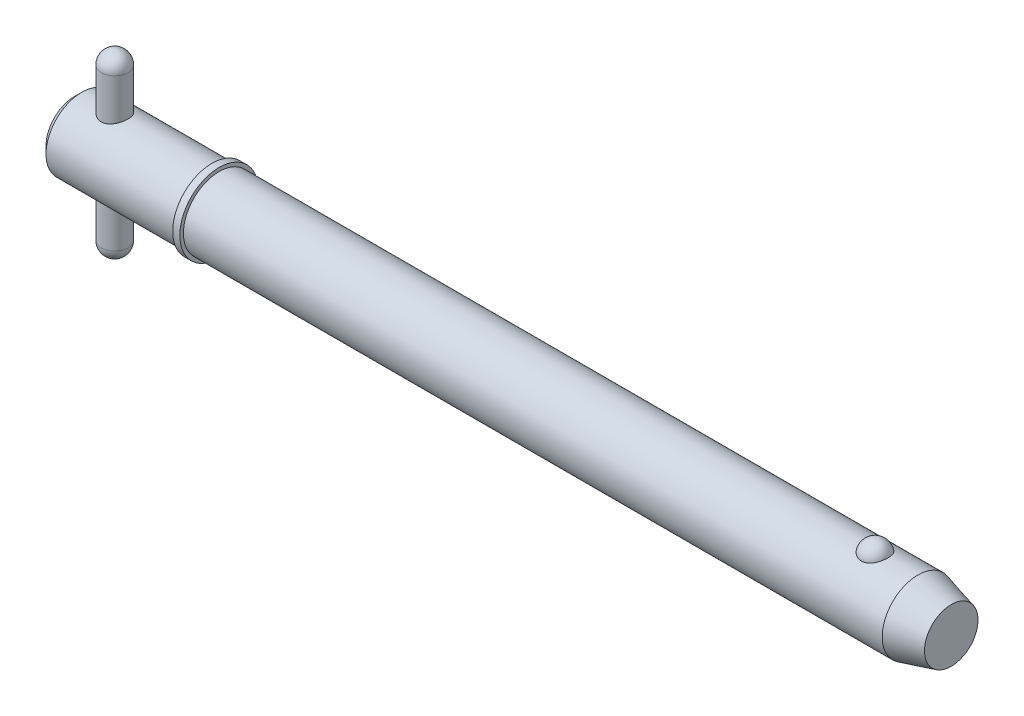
ISO-10303-21;
HEADER;
FILE_DESCRIPTION(('STEP AP214'),'2;1');
FILE_NAME('part.step','',(''),(''),'','','');
FILE_SCHEMA(('AUTOMOTIVE_DESIGN { 1 0 10303 214 1 1 1 1 }'));
ENDSEC;
DATA;
#1=APPLICATION_CONTEXT('core data for automotive mechanical design processes');
#2=APPLICATION_PROTOCOL_DEFINITION('international standard','automotive_design',2000,#1);
#3=PRODUCT_CONTEXT('',#1,'mechanical');
#4=PRODUCT('Part','Part','',(#3));
#5=PRODUCT_RELATED_PRODUCT_CATEGORY('part','',(#4));
#6=PRODUCT_DEFINITION_FORMATION('','',#4);
#7=PRODUCT_DEFINITION_CONTEXT('part definition',#1,'design');
#8=PRODUCT_DEFINITION('design','',#6,#7);
#9=PRODUCT_DEFINITION_SHAPE('','',#8);
#10=(LENGTH_UNIT() NAMED_UNIT(*) SI_UNIT(.MILLI.,.METRE.));
#11=(NAMED_UNIT(*) PLANE_ANGLE_UNIT() SI_UNIT($,.RADIAN.));
#12=(NAMED_UNIT(*) SI_UNIT($,.STERADIAN.) SOLID_ANGLE_UNIT());
#13=UNCERTAINTY_MEASURE_WITH_UNIT(LENGTH_MEASURE(1.E-05),#10,'distance_accuracy_value','');
#14=(GEOMETRIC_REPRESENTATION_CONTEXT(3) GLOBAL_UNCERTAINTY_ASSIGNED_CONTEXT((#13)) GLOBAL_UNIT_ASSIGNED_CONTEXT((#10,
#11,#12)) REPRESENTATION_CONTEXT('',''));
#15=CARTESIAN_POINT('',(0.,0.,0.));
#16=DIRECTION('',(0.,0.,1.));
#17=DIRECTION('',(1.,0.,0.));
#18=AXIS2_PLACEMENT_3D('',#15,#16,#17);
#19=CARTESIAN_POINT('',(7.14,15.875,0.));
#20=DIRECTION('',(0.,-1.,0.));
#21=DIRECTION('',(0.,0.,-1.));
#22=AXIS2_PLACEMENT_3D('',#19,#20,#21);
#23=CYLINDRICAL_SURFACE('',#22,2.38);
#24=CARTESIAN_POINT('',(7.14,-13.495,0.));
#25=DIRECTION('',(0.,-1.,0.));
#26=DIRECTION('',(0.,0.,-1.));
#27=AXIS2_PLACEMENT_3D('',#24,#25,#26);
#28=CIRCLE('',#27,2.38);
#29=CARTESIAN_POINT('',(7.14,-13.495,-2.38));
#30=VERTEX_POINT('',#29);
#31=EDGE_CURVE('P0_E10',#30,#30,#28,.F.);
#32=ORIENTED_EDGE('',*,*,#31,.T.);
#33=EDGE_LOOP('',(#32));
#34=FACE_BOUND('',#33,.T.);
#35=CARTESIAN_POINT('',(7.14,13.495,0.));
#36=DIRECTION('',(0.,-1.,0.));
#37=DIRECTION('',(0.,0.,-1.));
#38=AXIS2_PLACEMENT_3D('',#35,#36,#37);
#39=CIRCLE('',#38,2.38);
#40=CARTESIAN_POINT('',(7.14,13.495,-2.38));
#41=VERTEX_POINT('',#40);
#42=EDGE_CURVE('P0_E21',#41,#41,#39,.T.);
#43=ORIENTED_EDGE('',*,*,#42,.T.);
#44=EDGE_LOOP('',(#43));
#45=FACE_BOUND('',#44,.T.);
#46=ADVANCED_FACE('P0_F14',(#34,#45),#23,.T.);
#47=CARTESIAN_POINT('',(7.14,-13.495,0.));
#48=DIRECTION('',(0.,0.,1.));
#49=DIRECTION('',(1.,0.,0.));
#50=AXIS2_PLACEMENT_3D('',#47,#48,#49);
#51=SPHERICAL_SURFACE('',#50,2.38);
#52=CARTESIAN_POINT('',(7.14,-13.495,0.));
#53=DIRECTION('',(0.,-1.,0.));
#54=DIRECTION('',(0.,0.,-1.));
#55=AXIS2_PLACEMENT_3D('',#52,#53,#54);
#56=SPHERICAL_SURFACE('',#55,2.38);
#57=ORIENTED_EDGE('',*,*,#31,.F.);
#58=EDGE_LOOP('',(#57));
#59=FACE_BOUND('',#58,.T.);
#60=ADVANCED_FACE('P0_F29',(#59),#56,.T.);
#61=CARTESIAN_POINT('',(7.14,13.495,0.));
#62=DIRECTION('',(0.,0.,1.));
#63=DIRECTION('',(1.,0.,0.));
#64=AXIS2_PLACEMENT_3D('',#61,#62,#63);
#65=SPHERICAL_SURFACE('',#64,2.38);
#66=CARTESIAN_POINT('',(7.14,13.495,0.));
#67=DIRECTION('',(0.,-1.,0.));
#68=DIRECTION('',(0.,0.,-1.));
#69=AXIS2_PLACEMENT_3D('',#66,#67,#68);
#70=SPHERICAL_SURFACE('',#69,2.38);
#71=ORIENTED_EDGE('',*,*,#42,.F.);
#72=EDGE_LOOP('',(#71));
#73=FACE_BOUND('',#72,.T.);
#74=ADVANCED_FACE('P0_F16',(#73),#70,.T.);
#75=CLOSED_SHELL('',(#46,#60,#74));
#76=MANIFOLD_SOLID_BREP('P0_B1',#75);
#77=CARTESIAN_POINT('',(0.,0.,0.));
#78=DIRECTION('',(1.,0.,0.));
#79=DIRECTION('',(0.,0.,-1.));
#80=AXIS2_PLACEMENT_3D('',#77,#78,#79);
#81=CYLINDRICAL_SURFACE('',#80,6.35);
#82=CARTESIAN_POINT('',(149.955369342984,0.,0.));
#83=DIRECTION('',(1.,0.,0.));
#84=DIRECTION('',(0.,0.,-1.));
#85=AXIS2_PLACEMENT_3D('',#82,#83,#84);
#86=CIRCLE('',#85,6.35);
#87=CARTESIAN_POINT('',(149.955369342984,0.,-6.35));
#88=VERTEX_POINT('',#87);
#89=EDGE_CURVE('P1_E81',#88,#88,#86,.T.);
#90=ORIENTED_EDGE('',*,*,#89,.F.);
#91=EDGE_LOOP('',(#90));
#92=FACE_BOUND('',#91,.T.);
#93=CARTESIAN_POINT('',(25.7,0.,0.));
#94=DIRECTION('',(1.,0.,0.));
#95=DIRECTION('',(0.,0.,-1.));
#96=AXIS2_PLACEMENT_3D('',#93,#94,#95);
#97=CIRCLE('',#96,6.35);
#98=CARTESIAN_POINT('',(25.7,0.,-6.35));
#99=VERTEX_POINT('',#98);
#100=EDGE_CURVE('P1_E85',#99,#99,#97,.T.);
#101=ORIENTED_EDGE('',*,*,#100,.T.);
#102=EDGE_LOOP('',(#101));
#103=FACE_BOUND('',#102,.T.);
#104=CARTESIAN_POINT('',(142.330021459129,5.87502187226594,2.40969251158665));
#105=CARTESIAN_POINT('',(142.205030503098,5.87501645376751,2.40969773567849));
#106=CARTESIAN_POINT('',(142.080080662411,5.87916061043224,2.39967292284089));
#107=CARTESIAN_POINT('',(141.833909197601,5.89523112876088,2.35991730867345));
#108=CARTESIAN_POINT('',(141.712686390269,5.90715499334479,2.33019283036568));
#109=CARTESIAN_POINT('',(141.477517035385,5.93739567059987,2.25201402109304));
#110=CARTESIAN_POINT('',(141.363560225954,5.95570321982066,2.20358681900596));
#111=CARTESIAN_POINT('',(141.14557352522,5.99672067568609,2.08937987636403));
#112=CARTESIAN_POINT('',(141.041545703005,6.0194314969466,2.02359652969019));
#113=CARTESIAN_POINT('',(140.842943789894,6.06760647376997,1.87428969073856));
#114=CARTESIAN_POINT('',(140.748726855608,6.09313095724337,1.79031110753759));
#115=CARTESIAN_POINT('',(140.575255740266,6.14375873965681,1.6080017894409));
#116=CARTESIAN_POINT('',(140.496004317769,6.16886196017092,1.50966841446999));
#117=CARTESIAN_POINT('',(140.350845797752,6.21724600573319,1.29645884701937));
#118=CARTESIAN_POINT('',(140.285688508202,6.24039621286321,1.1810415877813));
#119=CARTESIAN_POINT('',(140.174703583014,6.28117277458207,0.940351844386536));
#120=CARTESIAN_POINT('',(140.128877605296,6.29879865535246,0.815078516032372));
#121=CARTESIAN_POINT('',(140.057023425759,6.32692073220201,0.556494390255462));
#122=CARTESIAN_POINT('',(140.031249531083,6.33732517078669,0.423102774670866));
#123=CARTESIAN_POINT('',(140.000988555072,6.34957673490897,0.153542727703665));
#124=CARTESIAN_POINT('',(139.996500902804,6.35142408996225,0.0173743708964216));
#125=CARTESIAN_POINT('',(140.008865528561,6.34638925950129,-0.253036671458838));
#126=CARTESIAN_POINT('',(140.025594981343,6.33955731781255,-0.387285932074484));
#127=CARTESIAN_POINT('',(140.079843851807,6.31794129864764,-0.650851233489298));
#128=CARTESIAN_POINT('',(140.117363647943,6.3031570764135,-0.780167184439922));
#129=CARTESIAN_POINT('',(140.212500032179,6.26711642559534,-1.03041949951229));
#130=CARTESIAN_POINT('',(140.270143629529,6.24585130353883,-1.15134433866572));
#131=CARTESIAN_POINT('',(140.404352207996,6.19905619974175,-1.38129800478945));
#132=CARTESIAN_POINT('',(140.480918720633,6.17352587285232,-1.49032586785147));
#133=CARTESIAN_POINT('',(140.651753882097,6.12080227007,-1.69393164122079));
#134=CARTESIAN_POINT('',(140.746100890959,6.09360200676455,-1.78844209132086));
#135=CARTESIAN_POINT('',(140.950119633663,6.04070434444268,-1.95970536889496));
#136=CARTESIAN_POINT('',(141.059790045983,6.015006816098,-2.0364597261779));
#137=CARTESIAN_POINT('',(141.289187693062,5.96867714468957,-2.16845644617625));
#138=CARTESIAN_POINT('',(141.408652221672,5.94794910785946,-2.22412062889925));
#139=CARTESIAN_POINT('',(141.656218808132,5.91340580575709,-2.31440992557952));
#140=CARTESIAN_POINT('',(141.784317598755,5.89958794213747,-2.34904294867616));
#141=CARTESIAN_POINT('',(142.038582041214,5.88111049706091,-2.39491590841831));
#142=CARTESIAN_POINT('',(142.164520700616,5.87602512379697,-2.40724512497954));
#143=CARTESIAN_POINT('',(142.416786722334,5.87428980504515,-2.41147867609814));
#144=CARTESIAN_POINT('',(142.543114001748,5.8776381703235,-2.40338710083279));
#145=CARTESIAN_POINT('',(142.788417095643,5.89212921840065,-2.36762715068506));
#146=CARTESIAN_POINT('',(142.907499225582,5.90302431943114,-2.3405803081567));
#147=CARTESIAN_POINT('',(143.13924472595,5.93113752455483,-2.26839066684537));
#148=CARTESIAN_POINT('',(143.251907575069,5.94835614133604,-2.22324640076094));
#149=CARTESIAN_POINT('',(143.470400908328,5.9877301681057,-2.11493806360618));
#150=CARTESIAN_POINT('',(143.576028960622,6.00998499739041,-2.05140269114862));
#151=CARTESIAN_POINT('',(143.775300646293,6.05690144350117,-1.90842705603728));
#152=CARTESIAN_POINT('',(143.868941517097,6.08156361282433,-1.82898313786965));
#153=CARTESIAN_POINT('',(144.046675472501,6.13211715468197,-1.65182429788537));
#154=CARTESIAN_POINT('',(144.130055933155,6.15800825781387,-1.5533938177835));
#155=CARTESIAN_POINT('',(144.279790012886,6.20712834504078,-1.34374214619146));
#156=CARTESIAN_POINT('',(144.346140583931,6.23035685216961,-1.23251867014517));
#157=CARTESIAN_POINT('',(144.462345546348,6.27251177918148,-0.996447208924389));
#158=CARTESIAN_POINT('',(144.511607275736,6.29127762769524,-0.871278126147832));
#159=CARTESIAN_POINT('',(144.589614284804,6.3215862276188,-0.613870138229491));
#160=CARTESIAN_POINT('',(144.618359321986,6.33312889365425,-0.481631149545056));
#161=CARTESIAN_POINT('',(144.654770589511,6.34782349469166,-0.213672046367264));
#162=CARTESIAN_POINT('',(144.662413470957,6.35096613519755,-0.0779482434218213));
#163=CARTESIAN_POINT('',(144.656395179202,6.34851322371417,0.192943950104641));
#164=CARTESIAN_POINT('',(144.642734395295,6.3429178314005,0.328112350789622));
#165=CARTESIAN_POINT('',(144.59450361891,6.32360512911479,0.593406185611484));
#166=CARTESIAN_POINT('',(144.560031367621,6.30992579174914,0.723552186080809));
#167=CARTESIAN_POINT('',(144.470953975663,6.27586325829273,0.97583417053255));
#168=CARTESIAN_POINT('',(144.41634761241,6.25547965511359,1.09796966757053));
#169=CARTESIAN_POINT('',(144.28775879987,6.20998183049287,1.33148921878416));
#170=CARTESIAN_POINT('',(144.213674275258,6.18484288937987,1.44281227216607));
#171=CARTESIAN_POINT('',(144.047820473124,6.13258735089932,1.65087683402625));
#172=CARTESIAN_POINT('',(143.956051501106,6.10547078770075,1.74761859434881));
#173=CARTESIAN_POINT('',(143.757183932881,6.05235879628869,1.92350926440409));
#174=CARTESIAN_POINT('',(143.650133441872,6.02636017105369,2.00271146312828));
#175=CARTESIAN_POINT('',(143.423138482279,5.97843747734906,2.14154159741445));
#176=CARTESIAN_POINT('',(143.303191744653,5.9565141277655,2.20116608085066));
#177=CARTESIAN_POINT('',(143.044523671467,5.91812106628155,2.30250570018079));
#178=CARTESIAN_POINT('',(142.90506980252,5.90217533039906,2.34256795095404));
#179=CARTESIAN_POINT('',(142.620397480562,5.88063128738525,2.3961521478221));
#180=CARTESIAN_POINT('',(142.47518174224,5.87502816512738,2.40968644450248));
#181=CARTESIAN_POINT('',(142.330021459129,5.87502187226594,2.40969251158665));
#182=B_SPLINE_CURVE_WITH_KNOTS('',3,(#104,#105,#106,#107,#108,#109,#110,#111,#112,#113,#114,
#115,#116,#117,#118,#119,#120,#121,#122,#123,#124,#125,#126,#127,#128,#129,#130,#131,#132,#133,
#134,#135,#136,#137,#138,#139,#140,#141,#142,#143,#144,#145,#146,#147,#148,#149,#150,#151,#152,
#153,#154,#155,#156,#157,#158,#159,#160,#161,#162,#163,#164,#165,#166,#167,#168,#169,#170,#171,
#172,#173,#174,#175,#176,#177,#178,#179,#180,#181),.UNSPECIFIED.,.T.,.F.,(4,2,2,2,2,2,2,2,2,2,2,
2,2,2,2,2,2,2,2,2,2,2,2,2,2,2,2,2,2,2,2,2,2,2,2,2,2,2,4),(0.,0.374440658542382,
0.748761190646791,1.122540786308,1.4963981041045,1.88098871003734,2.26565013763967,
2.66741104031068,3.06920639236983,3.47601794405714,3.88281858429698,4.28727498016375,
4.69173873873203,5.09674745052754,5.50178895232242,5.90865911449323,6.31549420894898,
6.71369855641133,7.11175305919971,7.48978077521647,7.86773278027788,8.23383886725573,
8.59997464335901,8.97409044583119,9.34829231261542,9.74122667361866,10.1342313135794,
10.5397522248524,10.9452779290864,11.3512521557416,11.75721896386,12.1612938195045,
12.5653932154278,12.9716540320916,13.3779078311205,13.7829098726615,14.1879832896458,
14.6230486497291,15.0579114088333),.UNSPECIFIED.);
#183=CARTESIAN_POINT('',(142.330021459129,5.87502187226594,2.40969251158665));
#184=VERTEX_POINT('',#183);
#185=EDGE_CURVE('P1_E35',#184,#184,#182,.T.);
#186=ORIENTED_EDGE('',*,*,#185,.T.);
#187=EDGE_LOOP('',(#186));
#188=FACE_BOUND('',#187,.T.);
#189=ADVANCED_FACE('P1_F13',(#92,#103,#188),#81,.T.);
#190=CARTESIAN_POINT('',(0.,0.,0.));
#191=DIRECTION('',(-1.,0.,0.));
#192=DIRECTION('',(0.,0.,1.));
#193=AXIS2_PLACEMENT_3D('',#190,#191,#192);
#194=PLANE('',#193);
#195=CARTESIAN_POINT('',(0.,0.,0.));
#196=DIRECTION('',(1.,0.,0.));
#197=DIRECTION('',(0.,0.,-1.));
#198=AXIS2_PLACEMENT_3D('',#195,#196,#197);
#199=CIRCLE('',#198,5.08);
#200=CARTESIAN_POINT('',(0.,0.,-5.08));
#201=VERTEX_POINT('',#200);
#202=EDGE_CURVE('P1_E9',#201,#201,#199,.T.);
#203=ORIENTED_EDGE('',*,*,#202,.F.);
#204=EDGE_LOOP('',(#203));
#205=FACE_BOUND('',#204,.T.);
#206=ADVANCED_FACE('P1_F15',(#205),#194,.T.);
#207=CARTESIAN_POINT('',(1.27,0.,0.));
#208=DIRECTION('',(1.,0.,0.));
#209=DIRECTION('',(0.,0.,-1.));
#210=AXIS2_PLACEMENT_3D('',#207,#208,#209);
#211=CONICAL_SURFACE('',#210,6.35,0.78539816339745);
#212=ORIENTED_EDGE('',*,*,#202,.T.);
#213=EDGE_LOOP('',(#212));
#214=FACE_BOUND('',#213,.T.);
#215=CARTESIAN_POINT('',(1.27,0.,0.));
#216=DIRECTION('',(1.,0.,0.));
#217=DIRECTION('',(0.,0.,-1.));
#218=AXIS2_PLACEMENT_3D('',#215,#216,#217);
#219=CIRCLE('',#218,6.35);
#220=CARTESIAN_POINT('',(1.27,0.,-6.35));
#221=VERTEX_POINT('',#220);
#222=EDGE_CURVE('P1_E26',#221,#221,#219,.T.);
#223=ORIENTED_EDGE('',*,*,#222,.F.);
#224=EDGE_LOOP('',(#223));
#225=FACE_BOUND('',#224,.T.);
#226=ADVANCED_FACE('P1_F77',(#214,#225),#211,.T.);
#227=CARTESIAN_POINT('',(0.,0.,0.));
#228=DIRECTION('',(1.,0.,0.));
#229=DIRECTION('',(0.,0.,-1.));
#230=AXIS2_PLACEMENT_3D('',#227,#228,#229);
#231=CYLINDRICAL_SURFACE('',#230,6.35);
#232=CARTESIAN_POINT('',(7.14,-5.88711304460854,2.38));
#233=CARTESIAN_POINT('',(7.01146258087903,-5.88710856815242,2.38000480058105));
#234=CARTESIAN_POINT('',(6.88295682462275,-5.89136840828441,2.36955244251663));
#235=CARTESIAN_POINT('',(6.62981934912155,-5.90782785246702,2.32820953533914));
#236=CARTESIAN_POINT('',(6.50518751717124,-5.92002722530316,2.29731958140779));
#237=CARTESIAN_POINT('',(6.26352403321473,-5.95079384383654,2.21639366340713));
#238=CARTESIAN_POINT('',(6.14647496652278,-5.96934583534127,2.16640353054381));
#239=CARTESIAN_POINT('',(5.92237941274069,-6.01070278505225,2.04885862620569));
#240=CARTESIAN_POINT('',(5.81533593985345,-6.03350901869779,1.98129858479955));
#241=CARTESIAN_POINT('',(5.60897525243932,-6.08207341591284,1.82693902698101));
#242=CARTESIAN_POINT('',(5.51022503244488,-6.10791836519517,1.73940861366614));
#243=CARTESIAN_POINT('',(5.32840561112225,-6.15892405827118,1.54914379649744));
#244=CARTESIAN_POINT('',(5.24533975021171,-6.1840846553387,1.44640616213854));
#245=CARTESIAN_POINT('',(5.09451639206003,-6.23191821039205,1.22434014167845));
#246=CARTESIAN_POINT('',(5.02737511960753,-6.25447755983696,1.10456656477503));
#247=CARTESIAN_POINT('',(4.91443001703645,-6.2935236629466,0.854429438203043));
#248=CARTESIAN_POINT('',(4.86861879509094,-6.31001251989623,0.724069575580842));
#249=CARTESIAN_POINT('',(4.80162253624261,-6.33444370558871,0.46242122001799));
#250=CARTESIAN_POINT('',(4.77946137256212,-6.34272370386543,0.331414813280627));
#251=CARTESIAN_POINT('',(4.75726677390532,-6.35101600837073,0.0672982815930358));
#252=CARTESIAN_POINT('',(4.75722615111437,-6.35103100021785,-0.0658111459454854));
#253=CARTESIAN_POINT('',(4.77870510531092,-6.3430064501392,-0.323358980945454));
#254=CARTESIAN_POINT('',(4.79915922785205,-6.33536494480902,-0.447900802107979));
#255=CARTESIAN_POINT('',(4.85925493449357,-6.31340794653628,-0.69163609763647));
#256=CARTESIAN_POINT('',(4.89889787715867,-6.29909198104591,-0.810829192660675));
#257=CARTESIAN_POINT('',(4.9967414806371,-6.26494471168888,-1.04254212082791));
#258=CARTESIAN_POINT('',(5.05520370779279,-6.24503620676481,-1.1549396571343));
#259=CARTESIAN_POINT('',(5.1887948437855,-6.20171869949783,-1.3686079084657));
#260=CARTESIAN_POINT('',(5.26392912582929,-6.17830856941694,-1.46987502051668));
#261=CARTESIAN_POINT('',(5.43386591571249,-6.12878580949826,-1.66468415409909));
#262=CARTESIAN_POINT('',(5.52956139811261,-6.10259519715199,-1.75742857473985));
#263=CARTESIAN_POINT('',(5.73530435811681,-6.05155777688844,-1.92585331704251));
#264=CARTESIAN_POINT('',(5.84535542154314,-6.02671130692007,-2.00152936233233));
#265=CARTESIAN_POINT('',(6.07982989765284,-5.98068420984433,-2.13519109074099));
#266=CARTESIAN_POINT('',(6.20451768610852,-5.95959698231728,-2.19274775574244));
#267=CARTESIAN_POINT('',(6.4628145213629,-5.92455622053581,-2.28574558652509));
#268=CARTESIAN_POINT('',(6.59641856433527,-5.91059872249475,-2.32119904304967));
#269=CARTESIAN_POINT('',(6.86087441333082,-5.8923327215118,-2.36717069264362));
#270=CARTESIAN_POINT('',(6.99147192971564,-5.8875347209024,-2.37895573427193));
#271=CARTESIAN_POINT('',(7.25283805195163,-5.88674545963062,-2.38091046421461));
#272=CARTESIAN_POINT('',(7.38360660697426,-5.89075200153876,-2.37108554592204));
#273=CARTESIAN_POINT('',(7.63510696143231,-5.90662331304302,-2.33124781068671));
#274=CARTESIAN_POINT('',(7.75602069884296,-5.91810660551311,-2.30221396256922));
#275=CARTESIAN_POINT('',(7.99120505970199,-5.94718527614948,-2.22601401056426));
#276=CARTESIAN_POINT('',(8.10547431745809,-5.96478190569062,-2.17884419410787));
#277=CARTESIAN_POINT('',(8.32888632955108,-6.00491533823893,-2.06572311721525));
#278=CARTESIAN_POINT('',(8.43767672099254,-6.02761250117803,-1.99913452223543));
#279=CARTESIAN_POINT('',(8.6429894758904,-6.07511988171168,-1.84974438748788));
#280=CARTESIAN_POINT('',(8.73950733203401,-6.09993087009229,-1.76693691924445));
#281=CARTESIAN_POINT('',(8.9238741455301,-6.1507686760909,-1.58125563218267));
#282=CARTESIAN_POINT('',(9.01078732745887,-6.17677301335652,-1.47744327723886));
#283=CARTESIAN_POINT('',(9.16607127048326,-6.22556172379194,-1.25606967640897));
#284=CARTESIAN_POINT('',(9.23444197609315,-6.24834608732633,-1.13850838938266));
#285=CARTESIAN_POINT('',(9.3502493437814,-6.28811144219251,-0.893050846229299));
#286=CARTESIAN_POINT('',(9.39775808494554,-6.30511236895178,-0.765192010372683));
#287=CARTESIAN_POINT('',(9.47032640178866,-6.33145833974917,-0.502514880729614));
#288=CARTESIAN_POINT('',(9.49539651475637,-6.34080697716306,-0.367699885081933));
#289=CARTESIAN_POINT('',(9.52124059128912,-6.35045496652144,-0.103396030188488));
#290=CARTESIAN_POINT('',(9.52334421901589,-6.35124952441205,0.025945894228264));
#291=CARTESIAN_POINT('',(9.50661518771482,-6.34499064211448,0.283061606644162));
#292=CARTESIAN_POINT('',(9.48778504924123,-6.33793814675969,0.410835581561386));
#293=CARTESIAN_POINT('',(9.43065630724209,-6.31700307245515,0.658028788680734));
#294=CARTESIAN_POINT('',(9.39284291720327,-6.30329098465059,0.7775756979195));
#295=CARTESIAN_POINT('',(9.29930406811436,-6.27046903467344,1.00863789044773));
#296=CARTESIAN_POINT('',(9.2435752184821,-6.25135815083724,1.12015164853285));
#297=CARTESIAN_POINT('',(9.11312349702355,-6.20865254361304,1.33711407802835));
#298=CARTESIAN_POINT('',(9.03770094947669,-6.18490316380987,1.44211105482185));
#299=CARTESIAN_POINT('',(8.87110640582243,-6.13583718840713,1.63836897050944));
#300=CARTESIAN_POINT('',(8.77992879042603,-6.11052003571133,1.72962498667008));
#301=CARTESIAN_POINT('',(8.57869799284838,-6.05953829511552,1.90076098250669));
#302=CARTESIAN_POINT('',(8.46790320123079,-6.03392573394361,1.97978778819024));
#303=CARTESIAN_POINT('',(8.23379693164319,-5.98676607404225,2.11813466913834));
#304=CARTESIAN_POINT('',(8.11048418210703,-5.9652193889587,2.17745273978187));
#305=CARTESIAN_POINT('',(7.84900037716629,-5.92818393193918,2.27641807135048));
#306=CARTESIAN_POINT('',(7.71041678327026,-5.91299857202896,2.31510015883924));
#307=CARTESIAN_POINT('',(7.42787316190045,-5.89246887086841,2.36688002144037));
#308=CARTESIAN_POINT('',(7.28391673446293,-5.88711805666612,2.37999462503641));
#309=CARTESIAN_POINT('',(7.14,-5.88711304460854,2.38));
#310=B_SPLINE_CURVE_WITH_KNOTS('',3,(#232,#233,#234,#235,#236,#237,#238,#239,#240,#241,#242,
#243,#244,#245,#246,#247,#248,#249,#250,#251,#252,#253,#254,#255,#256,#257,#258,#259,#260,#261,
#262,#263,#264,#265,#266,#267,#268,#269,#270,#271,#272,#273,#274,#275,#276,#277,#278,#279,#280,
#281,#282,#283,#284,#285,#286,#287,#288,#289,#290,#291,#292,#293,#294,#295,#296,#297,#298,#299,
#300,#301,#302,#303,#304,#305,#306,#307,#308,#309),.UNSPECIFIED.,.T.,.F.,(4,2,2,2,2,2,2,2,2,2,2,
2,2,2,2,2,2,2,2,2,2,2,2,2,2,2,2,2,2,2,2,2,2,2,2,2,2,2,4),(0.,0.385076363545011,
0.770141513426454,1.15428843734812,1.53855071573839,1.94016118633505,2.3418570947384,
2.75720522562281,3.1724093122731,3.569721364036,3.96690431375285,4.34445758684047,
4.72203759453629,5.10511017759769,5.48830640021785,5.89390240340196,6.29959991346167,
6.71428455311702,7.12873839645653,7.52034494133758,7.91185376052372,8.28480528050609,
8.65783318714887,9.0448340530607,9.43197664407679,9.84363087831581,10.2552863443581,
10.6655081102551,11.0755371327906,11.4616919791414,11.847800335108,12.224507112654,
12.6012852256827,12.9938941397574,13.386643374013,13.8000944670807,14.2135876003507,
14.6450218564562,15.0761720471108),.UNSPECIFIED.);
#311=CARTESIAN_POINT('',(7.14,-5.88711304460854,2.38));
#312=VERTEX_POINT('',#311);
#313=EDGE_CURVE('P1_E17',#312,#312,#310,.T.);
#314=ORIENTED_EDGE('',*,*,#313,.F.);
#315=EDGE_LOOP('',(#314));
#316=FACE_BOUND('',#315,.T.);
#317=CARTESIAN_POINT('',(7.14,5.88711304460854,2.38));
#318=CARTESIAN_POINT('',(7.26853741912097,5.88710856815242,2.38000480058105));
#319=CARTESIAN_POINT('',(7.39704317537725,5.89136840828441,2.36955244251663));
#320=CARTESIAN_POINT('',(7.65018065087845,5.90782785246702,2.32820953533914));
#321=CARTESIAN_POINT('',(7.77481248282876,5.92002722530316,2.29731958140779));
#322=CARTESIAN_POINT('',(8.01647596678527,5.95079384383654,2.21639366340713));
#323=CARTESIAN_POINT('',(8.13352503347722,5.96934583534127,2.16640353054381));
#324=CARTESIAN_POINT('',(8.35762058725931,6.01070278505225,2.04885862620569));
#325=CARTESIAN_POINT('',(8.46466406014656,6.03350901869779,1.98129858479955));
#326=CARTESIAN_POINT('',(8.67102474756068,6.08207341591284,1.82693902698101));
#327=CARTESIAN_POINT('',(8.76977496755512,6.10791836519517,1.73940861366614));
#328=CARTESIAN_POINT('',(8.95159438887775,6.15892405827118,1.54914379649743));
#329=CARTESIAN_POINT('',(9.03466024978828,6.1840846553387,1.44640616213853));
#330=CARTESIAN_POINT('',(9.18548360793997,6.23191821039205,1.22434014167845));
#331=CARTESIAN_POINT('',(9.25262488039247,6.25447755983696,1.10456656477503));
#332=CARTESIAN_POINT('',(9.36556998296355,6.2935236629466,0.854429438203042));
#333=CARTESIAN_POINT('',(9.41138120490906,6.31001251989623,0.72406957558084));
#334=CARTESIAN_POINT('',(9.47837746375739,6.33444370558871,0.462421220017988));
#335=CARTESIAN_POINT('',(9.50053862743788,6.34272370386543,0.331414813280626));
#336=CARTESIAN_POINT('',(9.52273322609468,6.35101600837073,0.0672982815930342));
#337=CARTESIAN_POINT('',(9.52277384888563,6.35103100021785,-0.0658111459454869));
#338=CARTESIAN_POINT('',(9.50129489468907,6.3430064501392,-0.323358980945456));
#339=CARTESIAN_POINT('',(9.48084077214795,6.33536494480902,-0.447900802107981));
#340=CARTESIAN_POINT('',(9.42074506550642,6.31340794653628,-0.691636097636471));
#341=CARTESIAN_POINT('',(9.38110212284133,6.29909198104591,-0.810829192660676));
#342=CARTESIAN_POINT('',(9.2832585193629,6.26494471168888,-1.04254212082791));
#343=CARTESIAN_POINT('',(9.22479629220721,6.24503620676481,-1.1549396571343));
#344=CARTESIAN_POINT('',(9.0912051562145,6.20171869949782,-1.3686079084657));
#345=CARTESIAN_POINT('',(9.0160708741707,6.17830856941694,-1.46987502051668));
#346=CARTESIAN_POINT('',(8.84613408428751,6.12878580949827,-1.66468415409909));
#347=CARTESIAN_POINT('',(8.75043860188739,6.10259519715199,-1.75742857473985));
#348=CARTESIAN_POINT('',(8.54469564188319,6.05155777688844,-1.92585331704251));
#349=CARTESIAN_POINT('',(8.43464457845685,6.02671130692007,-2.00152936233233));
#350=CARTESIAN_POINT('',(8.20017010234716,5.98068420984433,-2.13519109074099));
#351=CARTESIAN_POINT('',(8.07548231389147,5.95959698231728,-2.19274775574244));
#352=CARTESIAN_POINT('',(7.8171854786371,5.9245562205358,-2.28574558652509));
#353=CARTESIAN_POINT('',(7.68358143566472,5.91059872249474,-2.32119904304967));
#354=CARTESIAN_POINT('',(7.41912558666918,5.8923327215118,-2.36717069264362));
#355=CARTESIAN_POINT('',(7.28852807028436,5.8875347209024,-2.37895573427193));
#356=CARTESIAN_POINT('',(7.02716194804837,5.88674545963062,-2.38091046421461));
#357=CARTESIAN_POINT('',(6.89639339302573,5.89075200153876,-2.37108554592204));
#358=CARTESIAN_POINT('',(6.64489303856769,5.90662331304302,-2.33124781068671));
#359=CARTESIAN_POINT('',(6.52397930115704,5.91810660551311,-2.30221396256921));
#360=CARTESIAN_POINT('',(6.288794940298,5.94718527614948,-2.22601401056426));
#361=CARTESIAN_POINT('',(6.17452568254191,5.96478190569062,-2.17884419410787));
#362=CARTESIAN_POINT('',(5.95111367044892,6.00491533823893,-2.06572311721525));
#363=CARTESIAN_POINT('',(5.84232327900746,6.02761250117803,-1.99913452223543));
#364=CARTESIAN_POINT('',(5.6370105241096,6.07511988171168,-1.84974438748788));
#365=CARTESIAN_POINT('',(5.54049266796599,6.09993087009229,-1.76693691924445));
#366=CARTESIAN_POINT('',(5.3561258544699,6.1507686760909,-1.58125563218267));
#367=CARTESIAN_POINT('',(5.26921267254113,6.17677301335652,-1.47744327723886));
#368=CARTESIAN_POINT('',(5.11392872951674,6.22556172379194,-1.25606967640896));
#369=CARTESIAN_POINT('',(5.04555802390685,6.24834608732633,-1.13850838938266));
#370=CARTESIAN_POINT('',(4.9297506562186,6.28811144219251,-0.893050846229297));
#371=CARTESIAN_POINT('',(4.88224191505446,6.30511236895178,-0.76519201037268));
#372=CARTESIAN_POINT('',(4.80967359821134,6.33145833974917,-0.502514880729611));
#373=CARTESIAN_POINT('',(4.78460348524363,6.34080697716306,-0.36769988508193));
#374=CARTESIAN_POINT('',(4.75875940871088,6.35045496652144,-0.103396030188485));
#375=CARTESIAN_POINT('',(4.75665578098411,6.35124952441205,0.025945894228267));
#376=CARTESIAN_POINT('',(4.77338481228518,6.34499064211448,0.283061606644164));
#377=CARTESIAN_POINT('',(4.79221495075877,6.33793814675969,0.410835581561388));
#378=CARTESIAN_POINT('',(4.84934369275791,6.31700307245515,0.658028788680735));
#379=CARTESIAN_POINT('',(4.88715708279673,6.30329098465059,0.777575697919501));
#380=CARTESIAN_POINT('',(4.98069593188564,6.27046903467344,1.00863789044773));
#381=CARTESIAN_POINT('',(5.0364247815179,6.25135815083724,1.12015164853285));
#382=CARTESIAN_POINT('',(5.16687650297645,6.20865254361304,1.33711407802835));
#383=CARTESIAN_POINT('',(5.24229905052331,6.18490316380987,1.44211105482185));
#384=CARTESIAN_POINT('',(5.40889359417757,6.13583718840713,1.63836897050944));
#385=CARTESIAN_POINT('',(5.50007120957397,6.11052003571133,1.72962498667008));
#386=CARTESIAN_POINT('',(5.70130200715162,6.05953829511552,1.90076098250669));
#387=CARTESIAN_POINT('',(5.81209679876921,6.03392573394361,1.97978778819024));
#388=CARTESIAN_POINT('',(6.04620306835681,5.98676607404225,2.11813466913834));
#389=CARTESIAN_POINT('',(6.16951581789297,5.9652193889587,2.17745273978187));
#390=CARTESIAN_POINT('',(6.43099962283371,5.92818393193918,2.27641807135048));
#391=CARTESIAN_POINT('',(6.56958321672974,5.91299857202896,2.31510015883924));
#392=CARTESIAN_POINT('',(6.85212683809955,5.89246887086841,2.36688002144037));
#393=CARTESIAN_POINT('',(6.99608326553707,5.88711805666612,2.37999462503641));
#394=CARTESIAN_POINT('',(7.14,5.88711304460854,2.38));
#395=B_SPLINE_CURVE_WITH_KNOTS('',3,(#317,#318,#319,#320,#321,#322,#323,#324,#325,#326,#327,
#328,#329,#330,#331,#332,#333,#334,#335,#336,#337,#338,#339,#340,#341,#342,#343,#344,#345,#346,
#347,#348,#349,#350,#351,#352,#353,#354,#355,#356,#357,#358,#359,#360,#361,#362,#363,#364,#365,
#366,#367,#368,#369,#370,#371,#372,#373,#374,#375,#376,#377,#378,#379,#380,#381,#382,#383,#384,
#385,#386,#387,#388,#389,#390,#391,#392,#393,#394),.UNSPECIFIED.,.T.,.F.,(4,2,2,2,2,2,2,2,2,2,2,
2,2,2,2,2,2,2,2,2,2,2,2,2,2,2,2,2,2,2,2,2,2,2,2,2,2,2,4),(0.,0.385076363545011,
0.770141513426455,1.15428843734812,1.53855071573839,1.94016118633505,2.3418570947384,
2.75720522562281,3.1724093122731,3.56972136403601,3.96690431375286,4.34445758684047,
4.72203759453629,5.10511017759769,5.48830640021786,5.89390240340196,6.29959991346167,
6.71428455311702,7.12873839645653,7.52034494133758,7.91185376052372,8.2848052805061,
8.65783318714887,9.0448340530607,9.43197664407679,9.84363087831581,10.2552863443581,
10.6655081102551,11.0755371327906,11.4616919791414,11.847800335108,12.2245071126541,
12.6012852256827,12.9938941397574,13.386643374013,13.8000944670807,14.2135876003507,
14.6450218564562,15.0761720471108),.UNSPECIFIED.);
#396=CARTESIAN_POINT('',(7.14,5.88711304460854,2.38));
#397=VERTEX_POINT('',#396);
#398=EDGE_CURVE('P1_E43',#397,#397,#395,.T.);
#399=ORIENTED_EDGE('',*,*,#398,.F.);
#400=EDGE_LOOP('',(#399));
#401=FACE_BOUND('',#400,.T.);
#402=ORIENTED_EDGE('',*,*,#222,.T.);
#403=EDGE_LOOP('',(#402));
#404=FACE_BOUND('',#403,.T.);
#405=CARTESIAN_POINT('',(24.43,0.,0.));
#406=DIRECTION('',(1.,0.,0.));
#407=DIRECTION('',(0.,0.,-1.));
#408=AXIS2_PLACEMENT_3D('',#405,#406,#407);
#409=CIRCLE('',#408,6.35);
#410=CARTESIAN_POINT('',(24.43,0.,-6.35));
#411=VERTEX_POINT('',#410);
#412=EDGE_CURVE('P1_E31',#411,#411,#409,.T.);
#413=ORIENTED_EDGE('',*,*,#412,.F.);
#414=EDGE_LOOP('',(#413));
#415=FACE_BOUND('',#414,.T.);
#416=ADVANCED_FACE('P1_F103',(#316,#401,#404,#415),#231,.T.);
#417=CARTESIAN_POINT('',(24.43,6.35,0.));
#418=DIRECTION('',(-1.,0.,0.));
#419=DIRECTION('',(0.,0.,1.));
#420=AXIS2_PLACEMENT_3D('',#417,#418,#419);
#421=PLANE('',#420);
#422=ORIENTED_EDGE('',*,*,#412,.T.);
#423=EDGE_LOOP('',(#422));
#424=FACE_BOUND('',#423,.T.);
#425=CARTESIAN_POINT('',(24.43,0.,0.));
#426=DIRECTION('',(1.,0.,0.));
#427=DIRECTION('',(0.,0.,-1.));
#428=AXIS2_PLACEMENT_3D('',#425,#426,#427);
#429=CIRCLE('',#428,6.985);
#430=CARTESIAN_POINT('',(24.43,0.,-6.985));
#431=VERTEX_POINT('',#430);
#432=EDGE_CURVE('P1_E91',#431,#431,#429,.T.);
#433=ORIENTED_EDGE('',*,*,#432,.F.);
#434=EDGE_LOOP('',(#433));
#435=FACE_BOUND('',#434,.T.);
#436=ADVANCED_FACE('P1_F100',(#424,#435),#421,.T.);
#437=CARTESIAN_POINT('',(0.,0.,0.));
#438=DIRECTION('',(1.,0.,0.));
#439=DIRECTION('',(0.,0.,-1.));
#440=AXIS2_PLACEMENT_3D('',#437,#438,#439);
#441=CYLINDRICAL_SURFACE('',#440,6.985);
#442=ORIENTED_EDGE('',*,*,#432,.T.);
#443=EDGE_LOOP('',(#442));
#444=FACE_BOUND('',#443,.T.);
#445=CARTESIAN_POINT('',(25.7,0.,0.));
#446=DIRECTION('',(1.,0.,0.));
#447=DIRECTION('',(0.,0.,-1.));
#448=AXIS2_PLACEMENT_3D('',#445,#446,#447);
#449=CIRCLE('',#448,6.985);
#450=CARTESIAN_POINT('',(25.7,0.,-6.985));
#451=VERTEX_POINT('',#450);
#452=EDGE_CURVE('P1_E88',#451,#451,#449,.T.);
#453=ORIENTED_EDGE('',*,*,#452,.F.);
#454=EDGE_LOOP('',(#453));
#455=FACE_BOUND('',#454,.T.);
#456=ADVANCED_FACE('P1_F68',(#444,#455),#441,.T.);
#457=CARTESIAN_POINT('',(25.7,6.985,0.));
#458=DIRECTION('',(1.,0.,0.));
#459=DIRECTION('',(0.,0.,-1.));
#460=AXIS2_PLACEMENT_3D('',#457,#458,#459);
#461=PLANE('',#460);
#462=ORIENTED_EDGE('',*,*,#452,.T.);
#463=EDGE_LOOP('',(#462));
#464=FACE_BOUND('',#463,.T.);
#465=ORIENTED_EDGE('',*,*,#100,.F.);
#466=EDGE_LOOP('',(#465));
#467=FACE_BOUND('',#466,.T.);
#468=ADVANCED_FACE('P1_F62',(#464,#467),#461,.T.);
#469=CARTESIAN_POINT('',(155.88,0.,0.));
#470=DIRECTION('',(-1.,0.,0.));
#471=DIRECTION('',(0.,0.,1.));
#472=AXIS2_PLACEMENT_3D('',#469,#470,#471);
#473=CONICAL_SURFACE('',#472,4.76250000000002,0.26179938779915);
#474=ORIENTED_EDGE('',*,*,#89,.T.);
#475=EDGE_LOOP('',(#474));
#476=FACE_BOUND('',#475,.T.);
#477=CARTESIAN_POINT('',(155.88,0.,0.));
#478=DIRECTION('',(1.,0.,0.));
#479=DIRECTION('',(0.,0.,-1.));
#480=AXIS2_PLACEMENT_3D('',#477,#478,#479);
#481=CIRCLE('',#480,4.76250000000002);
#482=CARTESIAN_POINT('',(155.88,0.,-4.76250000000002));
#483=VERTEX_POINT('',#482);
#484=EDGE_CURVE('P1_E42',#483,#483,#481,.T.);
#485=ORIENTED_EDGE('',*,*,#484,.F.);
#486=EDGE_LOOP('',(#485));
#487=FACE_BOUND('',#486,.T.);
#488=ADVANCED_FACE('P1_F59',(#476,#487),#473,.T.);
#489=CARTESIAN_POINT('',(155.88,4.76250000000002,0.));
#490=DIRECTION('',(1.,0.,0.));
#491=DIRECTION('',(0.,0.,-1.));
#492=AXIS2_PLACEMENT_3D('',#489,#490,#491);
#493=PLANE('',#492);
#494=ORIENTED_EDGE('',*,*,#484,.T.);
#495=EDGE_LOOP('',(#494));
#496=FACE_BOUND('',#495,.T.);
#497=ADVANCED_FACE('P1_F55',(#496),#493,.T.);
#498=CARTESIAN_POINT('',(142.330021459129,5.715,0.));
#499=DIRECTION('',(-1.,0.,0.));
#500=DIRECTION('',(0.,1.,0.));
#501=AXIS2_PLACEMENT_3D('',#498,#499,#500);
#502=SPHERICAL_SURFACE('',#501,2.41500000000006);
#503=ORIENTED_EDGE('',*,*,#185,.F.);
#504=EDGE_LOOP('',(#503));
#505=FACE_BOUND('',#504,.T.);
#506=ADVANCED_FACE('P1_F50',(#505),#502,.T.);
#507=CARTESIAN_POINT('',(7.14,-6.985,0.));
#508=DIRECTION('',(0.,1.,0.));
#509=DIRECTION('',(0.,0.,1.));
#510=AXIS2_PLACEMENT_3D('',#507,#508,#509);
#511=CYLINDRICAL_SURFACE('',#510,2.38);
#512=ORIENTED_EDGE('',*,*,#313,.T.);
#513=EDGE_LOOP('',(#512));
#514=FACE_BOUND('',#513,.T.);
#515=ORIENTED_EDGE('',*,*,#398,.T.);
#516=EDGE_LOOP('',(#515));
#517=FACE_BOUND('',#516,.T.);
#518=ADVANCED_FACE('P1_F54',(#514,#517),#511,.F.);
#519=CLOSED_SHELL('',(#189,#206,#226,#416,#436,#456,#468,#488,#497,#506,#518));
#520=MANIFOLD_SOLID_BREP('P1_B1',#519);
#521=ADVANCED_BREP_SHAPE_REPRESENTATION('',(#18,#76,#520),#14);
#522=SHAPE_DEFINITION_REPRESENTATION(#9,#521);
ENDSEC;
END-ISO-10303-21;
